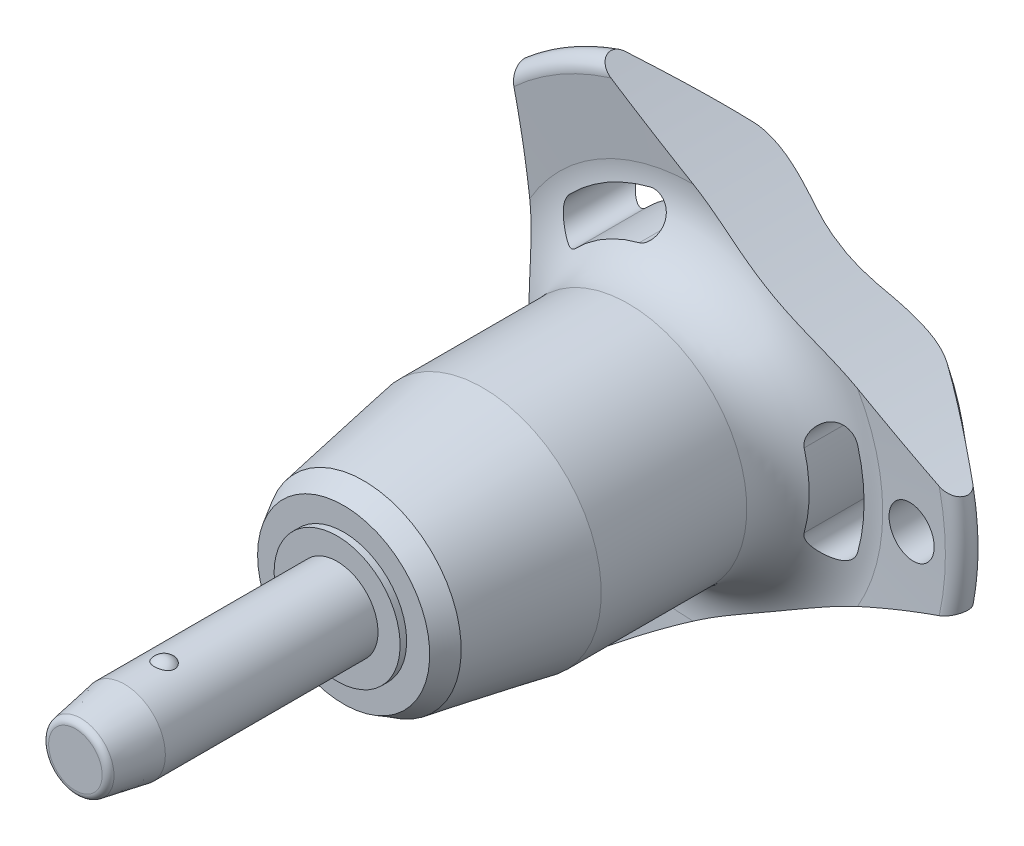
from build123d import *

# Parameters (mm, degrees)
SKETCH1_R           = 2.5
BOSS_EXTRUDE1_DEPTH = 10
SKETCH2_R           = 2.1
BOSS_EXTRUDE2_DEPTH = 26.7
BOSS_EXTRUDE3_START = 6
SKETCH1_2_R         = 2.5
BOSS_EXTRUDE3_DEPTH = 6
CHAMFER1_SIZE       = 3
CHAMFER1_SIZE2      = 0.528980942
FILLET1_R           = 0.4
SKETCH6_R           = 79.96
CUT_EXTRUDE1_DEPTH  = 44.566782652
CIRPATTERN1_COUNT   = 3
SKETCH7_R           = 1.5
CUT_EXTRUDE2_DEPTH  = 44.216000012


with BuildPart() as part:
    # Sketch1 → Boss-Extrude1 (new body)
    with BuildSketch(Plane.XY):
        Circle(SKETCH1_R)
    extrude(amount=-BOSS_EXTRUDE1_DEPTH)

    # Sketch2 → Boss-Extrude2 (add)
    with BuildSketch(Plane(origin=(0, 0, -10), x_dir=(-1, 0, 0), z_dir=(0, 0, -1))):
        Circle(SKETCH2_R)
    extrude(amount=BOSS_EXTRUDE2_DEPTH)

    # Sketch3 → Revolve1 (revolve)
    with BuildSketch(Plane(origin=(0, 0, 0), x_dir=(0, 0, -1), z_dir=(1, 0, 0))):
        with BuildLine():
            Line((-0.580947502, 2.75), (-0.580947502, 1.15))
            ThreePointArc((-0.580947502, 1.15), (0.219052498, 1.95), (-0.580947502, 2.75))
        make_face()
        with BuildLine():
            Line((-0.580947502, -1.15), (-0.580947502, -2.75))
            ThreePointArc((-0.580947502, -2.75), (0.219052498, -1.95), (-0.580947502, -1.15))
        make_face()
    revolve(axis=Axis((0, -1.15, 0.580947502), (0, 1, 0)))

    # Sketch1_2 → Boss-Extrude3 (add)
    with BuildSketch(Plane.XY.offset(BOSS_EXTRUDE3_START)):
        Circle(SKETCH1_2_R)
    extrude(amount=-BOSS_EXTRUDE3_DEPTH)

    # Chamfer1
    chamfer1_edges = [part.edges().sort_by_distance(p)[0] for p in [
        (-2.5, 0, 6),
    ]]
    chamfer1_side = [part.faces().sort_by_distance(p)[0] for p in [
        (-2.5, 0, -2),
    ]]
    chamfer(chamfer1_edges, length=CHAMFER1_SIZE, length2=CHAMFER1_SIZE2, reference=chamfer1_side[0])

    # Fillet1
    fillet1_edges = [part.edges().sort_by_distance(p)[0] for p in [
        (-1.971019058, 0, 6),
        (2.1, 0, -36.7),
    ]]
    fillet(fillet1_edges, radius=FILLET1_R)

    # Sketch4 → Revolve2 (revolve)
    with BuildSketch(Plane(origin=(0, 0, 0), x_dir=(0, 0, -1), z_dir=(1, 0, 0)), mode=Mode.PRIVATE) as revolve2_sk:
        Polygon((10, 0), (10, 3.851837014), (10.4, 3.851837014), (10.4, 5.26161122), (11.620900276, 5.966498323), (18.9, 7.25), (27.8, 7.25), (27.8, 0), align=None)
    revolve(revolve2_sk.sketch.rotate(Axis((0, 0, -27.8), (0, 0, 1)), 90), axis=Axis((0, 0, -27.8), (0, 0, 1)))

    # Sketch5 → Revolve3 (revolve)
    with BuildSketch(Plane(origin=(0, 0, 0), x_dir=(0, 0, -1), z_dir=(1, 0, 0)), mode=Mode.PRIVATE) as revolve3_sk:
        with BuildLine():
            Line((31.78715932, 11.570250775), (31.452568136, 15.735949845))
            ThreePointArc((31.452568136, 15.735949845), (31.946485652, 16.540188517), (32.862835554, 16.314230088))
            Line((32.862835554, 16.314230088), (36.326414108, 12.186497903))
            ThreePointArc((36.326414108, 12.186497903), (36.7, 11.109282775), (36.261488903, 10.056825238))
            ThreePointArc((36.261488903, 10.056825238), (33.289873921, 5.413681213), (32.25, 0))
            Line((32.25, 0), (27.8, 0))
            Line((27.8, 0), (27.8, 7.25))
            ThreePointArc((27.8, 7.25), (30.739473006, 8.537160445), (31.78715932, 11.570250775))
        make_face()
    revolve(revolve3_sk.sketch.rotate(Axis((0, 0, -32.25), (0, 0, 1)), 90), axis=Axis((0, 0, -32.25), (0, 0, 1)))

    # Sketch6 → Cut-Extrude1 (cut, through all)
    with BuildSketch(Plane.XY):
        with Locations((-89.76, 0)):
            Circle(SKETCH6_R)
        with BuildLine():
            ThreePointArc((10.099921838, -2.834717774), (10.490188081, 0), (10.099921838, 2.834717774))
            ThreePointArc((10.099921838, 2.834717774), (8.768180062, 3.582738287), (8.020159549, 2.250996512))
            ThreePointArc((8.020159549, 2.250996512), (8.330062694, 0), (8.020159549, -2.250996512))
            ThreePointArc((8.020159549, -2.250996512), (8.768180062, -3.582738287), (10.099921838, -2.834717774))
        make_face()
    cut_extrude1 = extrude(amount=-CUT_EXTRUDE1_DEPTH, mode=Mode.SUBTRACT)

    # CirPattern1: Cut-Extrude1 ×3 about axis
    cirpattern1_axis = Axis((0, 0, 0), (0, 0, 1))
    for i in range(1, CIRPATTERN1_COUNT):
        add(cut_extrude1.rotate(cirpattern1_axis, i * 360 / CIRPATTERN1_COUNT), mode=Mode.SUBTRACT)

    # Sketch7 → Cut-Extrude2 (cut, through all)
    with BuildSketch(Plane.XY):
        with Locations(Location((13.490188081, 0, 0), (0, 0, 225.221865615))):
            Circle(SKETCH7_R)
    extrude(amount=-CUT_EXTRUDE2_DEPTH, mode=Mode.SUBTRACT)


solid = part.part
